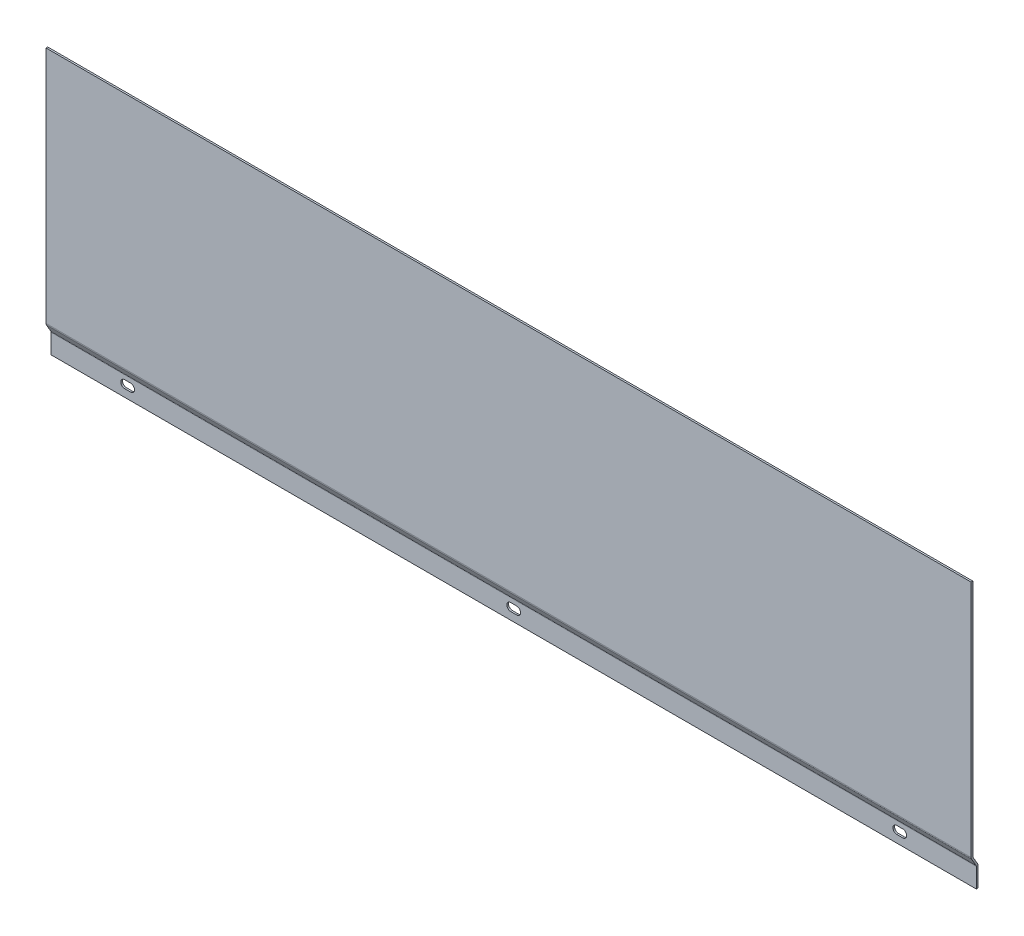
ISO-10303-21;
HEADER;
FILE_DESCRIPTION(('STEP AP214'),'2;1');
FILE_NAME('part.step','',(''),(''),'','','');
FILE_SCHEMA(('AUTOMOTIVE_DESIGN { 1 0 10303 214 1 1 1 1 }'));
ENDSEC;
DATA;
#1=APPLICATION_CONTEXT('core data for automotive mechanical design processes');
#2=APPLICATION_PROTOCOL_DEFINITION('international standard','automotive_design',2000,#1);
#3=PRODUCT_CONTEXT('',#1,'mechanical');
#4=PRODUCT('Part','Part','',(#3));
#5=PRODUCT_RELATED_PRODUCT_CATEGORY('part','',(#4));
#6=PRODUCT_DEFINITION_FORMATION('','',#4);
#7=PRODUCT_DEFINITION_CONTEXT('part definition',#1,'design');
#8=PRODUCT_DEFINITION('design','',#6,#7);
#9=PRODUCT_DEFINITION_SHAPE('','',#8);
#10=(LENGTH_UNIT() NAMED_UNIT(*) SI_UNIT(.MILLI.,.METRE.));
#11=(NAMED_UNIT(*) PLANE_ANGLE_UNIT() SI_UNIT($,.RADIAN.));
#12=(NAMED_UNIT(*) SI_UNIT($,.STERADIAN.) SOLID_ANGLE_UNIT());
#13=UNCERTAINTY_MEASURE_WITH_UNIT(LENGTH_MEASURE(1.E-05),#10,'distance_accuracy_value','');
#14=(GEOMETRIC_REPRESENTATION_CONTEXT(3) GLOBAL_UNCERTAINTY_ASSIGNED_CONTEXT((#13)) GLOBAL_UNIT_ASSIGNED_CONTEXT((#10,
#11,#12)) REPRESENTATION_CONTEXT('',''));
#15=CARTESIAN_POINT('',(0.,0.,0.));
#16=DIRECTION('',(0.,0.,1.));
#17=DIRECTION('',(1.,0.,0.));
#18=AXIS2_PLACEMENT_3D('',#15,#16,#17);
#19=CARTESIAN_POINT('',(810.,25.7942286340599,4.5));
#20=DIRECTION('',(0.,0.,1.));
#21=DIRECTION('',(1.,0.,0.));
#22=AXIS2_PLACEMENT_3D('',#19,#20,#21);
#23=PLANE('',#22);
#24=DIRECTION('',(0.,1.,0.));
#25=VECTOR('',#24,1.);
#26=CARTESIAN_POINT('',(0.,25.7942286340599,4.5));
#27=LINE('',#26,#25);
#28=CARTESIAN_POINT('',(0.,26.1961524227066,4.5));
#29=VERTEX_POINT('',#28);
#30=CARTESIAN_POINT('',(0.,235.,4.5));
#31=VERTEX_POINT('',#30);
#32=EDGE_CURVE('E291',#29,#31,#27,.T.);
#33=ORIENTED_EDGE('',*,*,#32,.T.);
#34=DIRECTION('',(-1.,0.,0.));
#35=VECTOR('',#34,1.);
#36=CARTESIAN_POINT('',(810.,235.,4.5));
#37=LINE('',#36,#35);
#38=CARTESIAN_POINT('',(810.,235.,4.5));
#39=VERTEX_POINT('',#38);
#40=EDGE_CURVE('E423',#39,#31,#37,.T.);
#41=ORIENTED_EDGE('',*,*,#40,.F.);
#42=DIRECTION('',(0.,1.,0.));
#43=VECTOR('',#42,1.);
#44=CARTESIAN_POINT('',(810.,25.7942286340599,4.5));
#45=LINE('',#44,#43);
#46=CARTESIAN_POINT('',(810.,26.1961524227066,4.5));
#47=VERTEX_POINT('',#46);
#48=EDGE_CURVE('E301',#47,#39,#45,.T.);
#49=ORIENTED_EDGE('',*,*,#48,.F.);
#50=DIRECTION('',(-1.,0.,0.));
#51=VECTOR('',#50,1.);
#52=CARTESIAN_POINT('',(810.,26.1961524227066,4.5));
#53=LINE('',#52,#51);
#54=EDGE_CURVE('E345',#47,#29,#53,.T.);
#55=ORIENTED_EDGE('',*,*,#54,.T.);
#56=EDGE_LOOP('',(#33,#41,#49,#55));
#57=FACE_BOUND('',#56,.T.);
#58=ADVANCED_FACE('F38',(#57),#23,.F.);
#59=CARTESIAN_POINT('',(810.,235.,6.));
#60=DIRECTION('',(0.,1.,0.));
#61=DIRECTION('',(0.,0.,1.));
#62=AXIS2_PLACEMENT_3D('',#59,#60,#61);
#63=PLANE('',#62);
#64=DIRECTION('',(0.,0.,-1.));
#65=VECTOR('',#64,1.);
#66=CARTESIAN_POINT('',(0.,235.,6.));
#67=LINE('',#66,#65);
#68=CARTESIAN_POINT('',(0.,235.,6.));
#69=VERTEX_POINT('',#68);
#70=EDGE_CURVE('E348',#69,#31,#67,.T.);
#71=ORIENTED_EDGE('',*,*,#70,.F.);
#72=DIRECTION('',(-1.,0.,0.));
#73=VECTOR('',#72,1.);
#74=CARTESIAN_POINT('',(810.,235.,6.));
#75=LINE('',#74,#73);
#76=CARTESIAN_POINT('',(810.,235.,6.));
#77=VERTEX_POINT('',#76);
#78=EDGE_CURVE('E420',#77,#69,#75,.T.);
#79=ORIENTED_EDGE('',*,*,#78,.F.);
#80=DIRECTION('',(0.,0.,-1.));
#81=VECTOR('',#80,1.);
#82=CARTESIAN_POINT('',(810.,235.,6.));
#83=LINE('',#82,#81);
#84=EDGE_CURVE('E304',#77,#39,#83,.T.);
#85=ORIENTED_EDGE('',*,*,#84,.T.);
#86=ORIENTED_EDGE('',*,*,#40,.T.);
#87=EDGE_LOOP('',(#71,#79,#85,#86));
#88=FACE_BOUND('',#87,.T.);
#89=ADVANCED_FACE('F479',(#88),#63,.T.);
#90=CARTESIAN_POINT('',(810.,25.7942286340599,6.));
#91=DIRECTION('',(0.,0.,1.));
#92=DIRECTION('',(1.,0.,0.));
#93=AXIS2_PLACEMENT_3D('',#90,#91,#92);
#94=PLANE('',#93);
#95=DIRECTION('',(0.,1.,0.));
#96=VECTOR('',#95,1.);
#97=CARTESIAN_POINT('',(0.,25.7942286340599,6.));
#98=LINE('',#97,#96);
#99=CARTESIAN_POINT('',(0.,26.1961524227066,6.));
#100=VERTEX_POINT('',#99);
#101=EDGE_CURVE('E352',#100,#69,#98,.T.);
#102=ORIENTED_EDGE('',*,*,#101,.F.);
#103=DIRECTION('',(-1.,0.,0.));
#104=VECTOR('',#103,1.);
#105=CARTESIAN_POINT('',(810.,26.1961524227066,6.));
#106=LINE('',#105,#104);
#107=CARTESIAN_POINT('',(810.,26.1961524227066,6.));
#108=VERTEX_POINT('',#107);
#109=EDGE_CURVE('E417',#108,#100,#106,.T.);
#110=ORIENTED_EDGE('',*,*,#109,.F.);
#111=DIRECTION('',(0.,1.,0.));
#112=VECTOR('',#111,1.);
#113=CARTESIAN_POINT('',(810.,25.7942286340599,6.));
#114=LINE('',#113,#112);
#115=EDGE_CURVE('E309',#108,#77,#114,.T.);
#116=ORIENTED_EDGE('',*,*,#115,.T.);
#117=ORIENTED_EDGE('',*,*,#78,.T.);
#118=EDGE_LOOP('',(#102,#110,#116,#117));
#119=FACE_BOUND('',#118,.T.);
#120=ADVANCED_FACE('F40',(#119),#94,.T.);
#121=CARTESIAN_POINT('',(810.,26.1961524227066,3.));
#122=DIRECTION('',(-1.,0.,0.));
#123=DIRECTION('',(0.,0.,1.));
#124=AXIS2_PLACEMENT_3D('',#121,#122,#123);
#125=CYLINDRICAL_SURFACE('',#124,3.);
#126=CARTESIAN_POINT('',(0.,26.1961524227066,3.));
#127=DIRECTION('',(1.,0.,0.));
#128=DIRECTION('',(0.,0.,-1.));
#129=AXIS2_PLACEMENT_3D('',#126,#127,#128);
#130=CIRCLE('',#129,3.);
#131=CARTESIAN_POINT('',(0.,24.6961524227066,5.59807621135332));
#132=VERTEX_POINT('',#131);
#133=EDGE_CURVE('E356',#132,#100,#130,.F.);
#134=ORIENTED_EDGE('',*,*,#133,.F.);
#135=DIRECTION('',(-1.,0.,0.));
#136=VECTOR('',#135,1.);
#137=CARTESIAN_POINT('',(810.,24.6961524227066,5.59807621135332));
#138=LINE('',#137,#136);
#139=CARTESIAN_POINT('',(810.,24.6961524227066,5.59807621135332));
#140=VERTEX_POINT('',#139);
#141=EDGE_CURVE('E414',#140,#132,#138,.T.);
#142=ORIENTED_EDGE('',*,*,#141,.F.);
#143=CARTESIAN_POINT('',(810.,26.1961524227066,3.));
#144=DIRECTION('',(1.,0.,0.));
#145=DIRECTION('',(0.,0.,-1.));
#146=AXIS2_PLACEMENT_3D('',#143,#144,#145);
#147=CIRCLE('',#146,3.);
#148=EDGE_CURVE('E313',#140,#108,#147,.F.);
#149=ORIENTED_EDGE('',*,*,#148,.T.);
#150=ORIENTED_EDGE('',*,*,#109,.T.);
#151=EDGE_LOOP('',(#134,#142,#149,#150));
#152=FACE_BOUND('',#151,.T.);
#153=ADVANCED_FACE('F487',(#152),#125,.T.);
#154=CARTESIAN_POINT('',(810.,17.25,1.29903810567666));
#155=DIRECTION('',(0.,-0.5,0.866025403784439));
#156=DIRECTION('',(0.,-0.866025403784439,-0.5));
#157=AXIS2_PLACEMENT_3D('',#154,#155,#156);
#158=PLANE('',#157);
#159=DIRECTION('',(0.,0.866025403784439,0.5));
#160=VECTOR('',#159,1.);
#161=CARTESIAN_POINT('',(0.,17.25,1.29903810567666));
#162=LINE('',#161,#160);
#163=CARTESIAN_POINT('',(0.,17.9461524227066,1.70096189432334));
#164=VERTEX_POINT('',#163);
#165=EDGE_CURVE('E360',#164,#132,#162,.T.);
#166=ORIENTED_EDGE('',*,*,#165,.F.);
#167=DIRECTION('',(-1.,0.,0.));
#168=VECTOR('',#167,1.);
#169=CARTESIAN_POINT('',(810.,17.9461524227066,1.70096189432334));
#170=LINE('',#169,#168);
#171=CARTESIAN_POINT('',(810.,17.9461524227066,1.70096189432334));
#172=VERTEX_POINT('',#171);
#173=EDGE_CURVE('E411',#172,#164,#170,.T.);
#174=ORIENTED_EDGE('',*,*,#173,.F.);
#175=DIRECTION('',(0.,0.866025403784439,0.5));
#176=VECTOR('',#175,1.);
#177=CARTESIAN_POINT('',(810.,17.25,1.29903810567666));
#178=LINE('',#177,#176);
#179=EDGE_CURVE('E317',#172,#140,#178,.T.);
#180=ORIENTED_EDGE('',*,*,#179,.T.);
#181=ORIENTED_EDGE('',*,*,#141,.T.);
#182=EDGE_LOOP('',(#166,#174,#180,#181));
#183=FACE_BOUND('',#182,.T.);
#184=ADVANCED_FACE('F490',(#183),#158,.T.);
#185=CARTESIAN_POINT('',(810.,17.1961524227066,3.));
#186=DIRECTION('',(-1.,0.,0.));
#187=DIRECTION('',(0.,0.,1.));
#188=AXIS2_PLACEMENT_3D('',#185,#186,#187);
#189=CYLINDRICAL_SURFACE('',#188,1.5);
#190=CARTESIAN_POINT('',(0.,17.1961524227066,3.));
#191=DIRECTION('',(1.,0.,0.));
#192=DIRECTION('',(0.,0.,-1.));
#193=AXIS2_PLACEMENT_3D('',#190,#191,#192);
#194=CIRCLE('',#193,1.5);
#195=CARTESIAN_POINT('',(0.,17.1961524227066,1.5));
#196=VERTEX_POINT('',#195);
#197=EDGE_CURVE('E364',#196,#164,#194,.T.);
#198=ORIENTED_EDGE('',*,*,#197,.F.);
#199=DIRECTION('',(-1.,0.,0.));
#200=VECTOR('',#199,1.);
#201=CARTESIAN_POINT('',(810.,17.1961524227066,1.5));
#202=LINE('',#201,#200);
#203=CARTESIAN_POINT('',(810.,17.1961524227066,1.5));
#204=VERTEX_POINT('',#203);
#205=EDGE_CURVE('E408',#204,#196,#202,.T.);
#206=ORIENTED_EDGE('',*,*,#205,.F.);
#207=CARTESIAN_POINT('',(810.,17.1961524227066,3.));
#208=DIRECTION('',(1.,0.,0.));
#209=DIRECTION('',(0.,0.,-1.));
#210=AXIS2_PLACEMENT_3D('',#207,#208,#209);
#211=CIRCLE('',#210,1.5);
#212=EDGE_CURVE('E321',#204,#172,#211,.T.);
#213=ORIENTED_EDGE('',*,*,#212,.T.);
#214=ORIENTED_EDGE('',*,*,#173,.T.);
#215=EDGE_LOOP('',(#198,#206,#213,#214));
#216=FACE_BOUND('',#215,.T.);
#217=ADVANCED_FACE('F494',(#216),#189,.F.);
#218=CARTESIAN_POINT('',(810.,0.,1.5));
#219=DIRECTION('',(0.,0.,1.));
#220=DIRECTION('',(1.,0.,0.));
#221=AXIS2_PLACEMENT_3D('',#218,#219,#220);
#222=PLANE('',#221);
#223=CARTESIAN_POINT('',(402.4,10.,1.5));
#224=DIRECTION('',(0.,0.,1.));
#225=DIRECTION('',(-1.,0.,0.));
#226=AXIS2_PLACEMENT_3D('',#223,#224,#225);
#227=CIRCLE('',#226,3.4);
#228=CARTESIAN_POINT('',(402.4,13.4,1.5));
#229=VERTEX_POINT('',#228);
#230=CARTESIAN_POINT('',(402.4,6.6,1.5));
#231=VERTEX_POINT('',#230);
#232=EDGE_CURVE('E249',#229,#231,#227,.T.);
#233=ORIENTED_EDGE('',*,*,#232,.F.);
#234=DIRECTION('',(-1.,0.,0.));
#235=VECTOR('',#234,1.);
#236=CARTESIAN_POINT('',(402.4,13.4,1.5));
#237=LINE('',#236,#235);
#238=CARTESIAN_POINT('',(407.6,13.4,1.5));
#239=VERTEX_POINT('',#238);
#240=EDGE_CURVE('E226',#239,#229,#237,.T.);
#241=ORIENTED_EDGE('',*,*,#240,.F.);
#242=CARTESIAN_POINT('',(407.6,10.,1.5));
#243=DIRECTION('',(0.,0.,1.));
#244=DIRECTION('',(1.,0.,0.));
#245=AXIS2_PLACEMENT_3D('',#242,#243,#244);
#246=CIRCLE('',#245,3.4);
#247=CARTESIAN_POINT('',(407.6,6.6,1.5));
#248=VERTEX_POINT('',#247);
#249=EDGE_CURVE('E217',#248,#239,#246,.T.);
#250=ORIENTED_EDGE('',*,*,#249,.F.);
#251=DIRECTION('',(1.,0.,0.));
#252=VECTOR('',#251,1.);
#253=CARTESIAN_POINT('',(402.4,6.6,1.5));
#254=LINE('',#253,#252);
#255=EDGE_CURVE('E202',#231,#248,#254,.T.);
#256=ORIENTED_EDGE('',*,*,#255,.F.);
#257=EDGE_LOOP('',(#233,#241,#250,#256));
#258=FACE_BOUND('',#257,.T.);
#259=CARTESIAN_POINT('',(64.4,10.,1.5));
#260=DIRECTION('',(0.,0.,1.));
#261=DIRECTION('',(-1.,0.,0.));
#262=AXIS2_PLACEMENT_3D('',#259,#260,#261);
#263=CIRCLE('',#262,3.4);
#264=CARTESIAN_POINT('',(64.4,13.4,1.5));
#265=VERTEX_POINT('',#264);
#266=CARTESIAN_POINT('',(64.4,6.6,1.5));
#267=VERTEX_POINT('',#266);
#268=EDGE_CURVE('E256',#265,#267,#263,.T.);
#269=ORIENTED_EDGE('',*,*,#268,.F.);
#270=DIRECTION('',(-1.,0.,0.));
#271=VECTOR('',#270,1.);
#272=CARTESIAN_POINT('',(64.4,13.4,1.5));
#273=LINE('',#272,#271);
#274=CARTESIAN_POINT('',(69.6,13.4,1.5));
#275=VERTEX_POINT('',#274);
#276=EDGE_CURVE('E262',#275,#265,#273,.T.);
#277=ORIENTED_EDGE('',*,*,#276,.F.);
#278=CARTESIAN_POINT('',(69.6,10.,1.5));
#279=DIRECTION('',(0.,0.,1.));
#280=DIRECTION('',(1.,0.,0.));
#281=AXIS2_PLACEMENT_3D('',#278,#279,#280);
#282=CIRCLE('',#281,3.4);
#283=CARTESIAN_POINT('',(69.6,6.6,1.5));
#284=VERTEX_POINT('',#283);
#285=EDGE_CURVE('E281',#284,#275,#282,.T.);
#286=ORIENTED_EDGE('',*,*,#285,.F.);
#287=DIRECTION('',(1.,0.,0.));
#288=VECTOR('',#287,1.);
#289=CARTESIAN_POINT('',(64.4,6.6,1.5));
#290=LINE('',#289,#288);
#291=EDGE_CURVE('E277',#267,#284,#290,.T.);
#292=ORIENTED_EDGE('',*,*,#291,.F.);
#293=EDGE_LOOP('',(#269,#277,#286,#292));
#294=FACE_BOUND('',#293,.T.);
#295=DIRECTION('',(0.,1.,0.));
#296=VECTOR('',#295,1.);
#297=CARTESIAN_POINT('',(0.,0.,1.5));
#298=LINE('',#297,#296);
#299=CARTESIAN_POINT('',(0.,0.,1.5));
#300=VERTEX_POINT('',#299);
#301=EDGE_CURVE('E368',#300,#196,#298,.T.);
#302=ORIENTED_EDGE('',*,*,#301,.F.);
#303=DIRECTION('',(-1.,0.,0.));
#304=VECTOR('',#303,1.);
#305=CARTESIAN_POINT('',(810.,0.,1.5));
#306=LINE('',#305,#304);
#307=CARTESIAN_POINT('',(810.,0.,1.5));
#308=VERTEX_POINT('',#307);
#309=EDGE_CURVE('E405',#308,#300,#306,.T.);
#310=ORIENTED_EDGE('',*,*,#309,.F.);
#311=DIRECTION('',(0.,1.,0.));
#312=VECTOR('',#311,1.);
#313=CARTESIAN_POINT('',(810.,0.,1.5));
#314=LINE('',#313,#312);
#315=EDGE_CURVE('E325',#308,#204,#314,.T.);
#316=ORIENTED_EDGE('',*,*,#315,.T.);
#317=ORIENTED_EDGE('',*,*,#205,.T.);
#318=EDGE_LOOP('',(#302,#310,#316,#317));
#319=FACE_BOUND('',#318,.T.);
#320=CARTESIAN_POINT('',(740.4,10.,1.5));
#321=DIRECTION('',(0.,0.,1.));
#322=DIRECTION('',(-1.,0.,0.));
#323=AXIS2_PLACEMENT_3D('',#320,#321,#322);
#324=CIRCLE('',#323,3.4);
#325=CARTESIAN_POINT('',(740.4,13.4,1.5));
#326=VERTEX_POINT('',#325);
#327=CARTESIAN_POINT('',(740.4,6.6,1.5));
#328=VERTEX_POINT('',#327);
#329=EDGE_CURVE('E426',#326,#328,#324,.T.);
#330=ORIENTED_EDGE('',*,*,#329,.F.);
#331=DIRECTION('',(-1.,0.,0.));
#332=VECTOR('',#331,1.);
#333=CARTESIAN_POINT('',(740.4,13.4,1.5));
#334=LINE('',#333,#332);
#335=CARTESIAN_POINT('',(745.6,13.4,1.5));
#336=VERTEX_POINT('',#335);
#337=EDGE_CURVE('E429',#336,#326,#334,.T.);
#338=ORIENTED_EDGE('',*,*,#337,.F.);
#339=CARTESIAN_POINT('',(745.6,10.,1.5));
#340=DIRECTION('',(0.,0.,1.));
#341=DIRECTION('',(1.,0.,0.));
#342=AXIS2_PLACEMENT_3D('',#339,#340,#341);
#343=CIRCLE('',#342,3.4);
#344=CARTESIAN_POINT('',(745.6,6.6,1.5));
#345=VERTEX_POINT('',#344);
#346=EDGE_CURVE('E432',#345,#336,#343,.T.);
#347=ORIENTED_EDGE('',*,*,#346,.F.);
#348=DIRECTION('',(1.,0.,0.));
#349=VECTOR('',#348,1.);
#350=CARTESIAN_POINT('',(740.4,6.6,1.5));
#351=LINE('',#350,#349);
#352=EDGE_CURVE('E436',#328,#345,#351,.T.);
#353=ORIENTED_EDGE('',*,*,#352,.F.);
#354=EDGE_LOOP('',(#330,#338,#347,#353));
#355=FACE_BOUND('',#354,.T.);
#356=ADVANCED_FACE('F224',(#258,#294,#319,#355),#222,.T.);
#357=CARTESIAN_POINT('',(810.,0.,0.));
#358=DIRECTION('',(0.,-1.,0.));
#359=DIRECTION('',(0.,0.,-1.));
#360=AXIS2_PLACEMENT_3D('',#357,#358,#359);
#361=PLANE('',#360);
#362=DIRECTION('',(0.,0.,1.));
#363=VECTOR('',#362,1.);
#364=CARTESIAN_POINT('',(0.,0.,0.));
#365=LINE('',#364,#363);
#366=CARTESIAN_POINT('',(0.,0.,0.));
#367=VERTEX_POINT('',#366);
#368=EDGE_CURVE('E372',#367,#300,#365,.T.);
#369=ORIENTED_EDGE('',*,*,#368,.F.);
#370=DIRECTION('',(-1.,0.,0.));
#371=VECTOR('',#370,1.);
#372=CARTESIAN_POINT('',(810.,0.,0.));
#373=LINE('',#372,#371);
#374=CARTESIAN_POINT('',(810.,0.,0.));
#375=VERTEX_POINT('',#374);
#376=EDGE_CURVE('E402',#375,#367,#373,.T.);
#377=ORIENTED_EDGE('',*,*,#376,.F.);
#378=DIRECTION('',(0.,0.,1.));
#379=VECTOR('',#378,1.);
#380=CARTESIAN_POINT('',(810.,0.,0.));
#381=LINE('',#380,#379);
#382=EDGE_CURVE('E329',#375,#308,#381,.T.);
#383=ORIENTED_EDGE('',*,*,#382,.T.);
#384=ORIENTED_EDGE('',*,*,#309,.T.);
#385=EDGE_LOOP('',(#369,#377,#383,#384));
#386=FACE_BOUND('',#385,.T.);
#387=ADVANCED_FACE('F501',(#386),#361,.T.);
#388=CARTESIAN_POINT('',(810.,0.,0.));
#389=DIRECTION('',(0.,0.,1.));
#390=DIRECTION('',(1.,0.,0.));
#391=AXIS2_PLACEMENT_3D('',#388,#389,#390);
#392=PLANE('',#391);
#393=DIRECTION('',(-1.,0.,0.));
#394=VECTOR('',#393,1.);
#395=CARTESIAN_POINT('',(402.4,13.4,0.));
#396=LINE('',#395,#394);
#397=CARTESIAN_POINT('',(407.6,13.4,0.));
#398=VERTEX_POINT('',#397);
#399=CARTESIAN_POINT('',(402.4,13.4,0.));
#400=VERTEX_POINT('',#399);
#401=EDGE_CURVE('E245',#398,#400,#396,.T.);
#402=ORIENTED_EDGE('',*,*,#401,.T.);
#403=CARTESIAN_POINT('',(402.4,10.,0.));
#404=DIRECTION('',(0.,0.,1.));
#405=DIRECTION('',(-1.,0.,0.));
#406=AXIS2_PLACEMENT_3D('',#403,#404,#405);
#407=CIRCLE('',#406,3.4);
#408=CARTESIAN_POINT('',(402.4,6.6,0.));
#409=VERTEX_POINT('',#408);
#410=EDGE_CURVE('E252',#400,#409,#407,.T.);
#411=ORIENTED_EDGE('',*,*,#410,.T.);
#412=DIRECTION('',(1.,0.,0.));
#413=VECTOR('',#412,1.);
#414=CARTESIAN_POINT('',(402.4,6.6,0.));
#415=LINE('',#414,#413);
#416=CARTESIAN_POINT('',(407.6,6.6,0.));
#417=VERTEX_POINT('',#416);
#418=EDGE_CURVE('E213',#409,#417,#415,.T.);
#419=ORIENTED_EDGE('',*,*,#418,.T.);
#420=CARTESIAN_POINT('',(407.6,10.,0.));
#421=DIRECTION('',(0.,0.,1.));
#422=DIRECTION('',(1.,0.,0.));
#423=AXIS2_PLACEMENT_3D('',#420,#421,#422);
#424=CIRCLE('',#423,3.4);
#425=EDGE_CURVE('E220',#417,#398,#424,.T.);
#426=ORIENTED_EDGE('',*,*,#425,.T.);
#427=EDGE_LOOP('',(#402,#411,#419,#426));
#428=FACE_BOUND('',#427,.T.);
#429=DIRECTION('',(-1.,0.,0.));
#430=VECTOR('',#429,1.);
#431=CARTESIAN_POINT('',(64.4,13.4,0.));
#432=LINE('',#431,#430);
#433=CARTESIAN_POINT('',(69.6,13.4,0.));
#434=VERTEX_POINT('',#433);
#435=CARTESIAN_POINT('',(64.4,13.4,0.));
#436=VERTEX_POINT('',#435);
#437=EDGE_CURVE('E270',#434,#436,#432,.T.);
#438=ORIENTED_EDGE('',*,*,#437,.T.);
#439=CARTESIAN_POINT('',(64.4,10.,0.));
#440=DIRECTION('',(0.,0.,1.));
#441=DIRECTION('',(-1.,0.,0.));
#442=AXIS2_PLACEMENT_3D('',#439,#440,#441);
#443=CIRCLE('',#442,3.4);
#444=CARTESIAN_POINT('',(64.4,6.6,0.));
#445=VERTEX_POINT('',#444);
#446=EDGE_CURVE('E257',#436,#445,#443,.T.);
#447=ORIENTED_EDGE('',*,*,#446,.T.);
#448=DIRECTION('',(1.,0.,0.));
#449=VECTOR('',#448,1.);
#450=CARTESIAN_POINT('',(64.4,6.6,0.));
#451=LINE('',#450,#449);
#452=CARTESIAN_POINT('',(69.6,6.6,0.));
#453=VERTEX_POINT('',#452);
#454=EDGE_CURVE('E261',#445,#453,#451,.T.);
#455=ORIENTED_EDGE('',*,*,#454,.T.);
#456=CARTESIAN_POINT('',(69.6,10.,0.));
#457=DIRECTION('',(0.,0.,1.));
#458=DIRECTION('',(1.,0.,0.));
#459=AXIS2_PLACEMENT_3D('',#456,#457,#458);
#460=CIRCLE('',#459,3.4);
#461=EDGE_CURVE('E266',#453,#434,#460,.T.);
#462=ORIENTED_EDGE('',*,*,#461,.T.);
#463=EDGE_LOOP('',(#438,#447,#455,#462));
#464=FACE_BOUND('',#463,.T.);
#465=DIRECTION('',(0.,1.,0.));
#466=VECTOR('',#465,1.);
#467=CARTESIAN_POINT('',(0.,0.,0.));
#468=LINE('',#467,#466);
#469=CARTESIAN_POINT('',(0.,17.1961524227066,0.));
#470=VERTEX_POINT('',#469);
#471=EDGE_CURVE('E376',#367,#470,#468,.T.);
#472=ORIENTED_EDGE('',*,*,#471,.T.);
#473=DIRECTION('',(-1.,0.,0.));
#474=VECTOR('',#473,1.);
#475=CARTESIAN_POINT('',(810.,17.1961524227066,0.));
#476=LINE('',#475,#474);
#477=CARTESIAN_POINT('',(810.,17.1961524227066,0.));
#478=VERTEX_POINT('',#477);
#479=EDGE_CURVE('E398',#478,#470,#476,.T.);
#480=ORIENTED_EDGE('',*,*,#479,.F.);
#481=DIRECTION('',(0.,1.,0.));
#482=VECTOR('',#481,1.);
#483=CARTESIAN_POINT('',(810.,0.,0.));
#484=LINE('',#483,#482);
#485=EDGE_CURVE('E333',#375,#478,#484,.T.);
#486=ORIENTED_EDGE('',*,*,#485,.F.);
#487=ORIENTED_EDGE('',*,*,#376,.T.);
#488=EDGE_LOOP('',(#472,#480,#486,#487));
#489=FACE_BOUND('',#488,.T.);
#490=CARTESIAN_POINT('',(740.4,10.,0.));
#491=DIRECTION('',(0.,0.,1.));
#492=DIRECTION('',(-1.,0.,0.));
#493=AXIS2_PLACEMENT_3D('',#490,#491,#492);
#494=CIRCLE('',#493,3.4);
#495=CARTESIAN_POINT('',(740.4,13.4,0.));
#496=VERTEX_POINT('',#495);
#497=CARTESIAN_POINT('',(740.4,6.6,0.));
#498=VERTEX_POINT('',#497);
#499=EDGE_CURVE('E54',#496,#498,#494,.T.);
#500=ORIENTED_EDGE('',*,*,#499,.T.);
#501=DIRECTION('',(1.,0.,0.));
#502=VECTOR('',#501,1.);
#503=CARTESIAN_POINT('',(740.4,6.6,0.));
#504=LINE('',#503,#502);
#505=CARTESIAN_POINT('',(745.6,6.6,0.));
#506=VERTEX_POINT('',#505);
#507=EDGE_CURVE('E442',#498,#506,#504,.T.);
#508=ORIENTED_EDGE('',*,*,#507,.T.);
#509=CARTESIAN_POINT('',(745.6,10.,0.));
#510=DIRECTION('',(0.,0.,1.));
#511=DIRECTION('',(1.,0.,0.));
#512=AXIS2_PLACEMENT_3D('',#509,#510,#511);
#513=CIRCLE('',#512,3.4);
#514=CARTESIAN_POINT('',(745.6,13.4,0.));
#515=VERTEX_POINT('',#514);
#516=EDGE_CURVE('E61',#506,#515,#513,.T.);
#517=ORIENTED_EDGE('',*,*,#516,.T.);
#518=DIRECTION('',(-1.,0.,0.));
#519=VECTOR('',#518,1.);
#520=CARTESIAN_POINT('',(740.4,13.4,0.));
#521=LINE('',#520,#519);
#522=EDGE_CURVE('E447',#515,#496,#521,.T.);
#523=ORIENTED_EDGE('',*,*,#522,.T.);
#524=EDGE_LOOP('',(#500,#508,#517,#523));
#525=FACE_BOUND('',#524,.T.);
#526=ADVANCED_FACE('F504',(#428,#464,#489,#525),#392,.F.);
#527=CARTESIAN_POINT('',(810.,17.1961524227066,3.));
#528=DIRECTION('',(-1.,0.,0.));
#529=DIRECTION('',(0.,0.,1.));
#530=AXIS2_PLACEMENT_3D('',#527,#528,#529);
#531=CYLINDRICAL_SURFACE('',#530,3.);
#532=CARTESIAN_POINT('',(0.,17.1961524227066,3.));
#533=DIRECTION('',(-1.,0.,0.));
#534=DIRECTION('',(0.,0.,1.));
#535=AXIS2_PLACEMENT_3D('',#532,#533,#534);
#536=CIRCLE('',#535,3.);
#537=CARTESIAN_POINT('',(0.,18.6961524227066,0.401923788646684));
#538=VERTEX_POINT('',#537);
#539=EDGE_CURVE('E379',#470,#538,#536,.F.);
#540=ORIENTED_EDGE('',*,*,#539,.T.);
#541=DIRECTION('',(-1.,0.,0.));
#542=VECTOR('',#541,1.);
#543=CARTESIAN_POINT('',(810.,18.6961524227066,0.401923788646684));
#544=LINE('',#543,#542);
#545=CARTESIAN_POINT('',(810.,18.6961524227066,0.401923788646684));
#546=VERTEX_POINT('',#545);
#547=EDGE_CURVE('E394',#546,#538,#544,.T.);
#548=ORIENTED_EDGE('',*,*,#547,.F.);
#549=CARTESIAN_POINT('',(810.,17.1961524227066,3.));
#550=DIRECTION('',(-1.,0.,0.));
#551=DIRECTION('',(0.,0.,1.));
#552=AXIS2_PLACEMENT_3D('',#549,#550,#551);
#553=CIRCLE('',#552,3.);
#554=EDGE_CURVE('E336',#478,#546,#553,.F.);
#555=ORIENTED_EDGE('',*,*,#554,.F.);
#556=ORIENTED_EDGE('',*,*,#479,.T.);
#557=EDGE_LOOP('',(#540,#548,#555,#556));
#558=FACE_BOUND('',#557,.T.);
#559=ADVANCED_FACE('F508',(#558),#531,.T.);
#560=CARTESIAN_POINT('',(810.,18.,0.));
#561=DIRECTION('',(0.,-0.5,0.866025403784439));
#562=DIRECTION('',(0.,-0.866025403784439,-0.5));
#563=AXIS2_PLACEMENT_3D('',#560,#561,#562);
#564=PLANE('',#563);
#565=DIRECTION('',(0.,0.866025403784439,0.5));
#566=VECTOR('',#565,1.);
#567=CARTESIAN_POINT('',(0.,18.,0.));
#568=LINE('',#567,#566);
#569=CARTESIAN_POINT('',(0.,25.4461524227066,4.29903810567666));
#570=VERTEX_POINT('',#569);
#571=EDGE_CURVE('E382',#538,#570,#568,.T.);
#572=ORIENTED_EDGE('',*,*,#571,.T.);
#573=DIRECTION('',(-1.,0.,0.));
#574=VECTOR('',#573,1.);
#575=CARTESIAN_POINT('',(810.,25.4461524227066,4.29903810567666));
#576=LINE('',#575,#574);
#577=CARTESIAN_POINT('',(810.,25.4461524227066,4.29903810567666));
#578=VERTEX_POINT('',#577);
#579=EDGE_CURVE('E390',#578,#570,#576,.T.);
#580=ORIENTED_EDGE('',*,*,#579,.F.);
#581=DIRECTION('',(0.,0.866025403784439,0.5));
#582=VECTOR('',#581,1.);
#583=CARTESIAN_POINT('',(810.,18.,0.));
#584=LINE('',#583,#582);
#585=EDGE_CURVE('E339',#546,#578,#584,.T.);
#586=ORIENTED_EDGE('',*,*,#585,.F.);
#587=ORIENTED_EDGE('',*,*,#547,.T.);
#588=EDGE_LOOP('',(#572,#580,#586,#587));
#589=FACE_BOUND('',#588,.T.);
#590=ADVANCED_FACE('F512',(#589),#564,.F.);
#591=CARTESIAN_POINT('',(810.,26.1961524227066,3.));
#592=DIRECTION('',(-1.,0.,0.));
#593=DIRECTION('',(0.,0.,1.));
#594=AXIS2_PLACEMENT_3D('',#591,#592,#593);
#595=CYLINDRICAL_SURFACE('',#594,1.5);
#596=CARTESIAN_POINT('',(0.,26.1961524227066,3.));
#597=DIRECTION('',(1.,0.,0.));
#598=DIRECTION('',(0.,0.,-1.));
#599=AXIS2_PLACEMENT_3D('',#596,#597,#598);
#600=CIRCLE('',#599,1.5);
#601=EDGE_CURVE('E305',#570,#29,#600,.F.);
#602=ORIENTED_EDGE('',*,*,#601,.T.);
#603=ORIENTED_EDGE('',*,*,#54,.F.);
#604=CARTESIAN_POINT('',(810.,26.1961524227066,3.));
#605=DIRECTION('',(1.,0.,0.));
#606=DIRECTION('',(0.,0.,-1.));
#607=AXIS2_PLACEMENT_3D('',#604,#605,#606);
#608=CIRCLE('',#607,1.5);
#609=EDGE_CURVE('E342',#578,#47,#608,.F.);
#610=ORIENTED_EDGE('',*,*,#609,.F.);
#611=ORIENTED_EDGE('',*,*,#579,.T.);
#612=EDGE_LOOP('',(#602,#603,#610,#611));
#613=FACE_BOUND('',#612,.T.);
#614=ADVANCED_FACE('F516',(#613),#595,.F.);
#615=CARTESIAN_POINT('',(810.,26.1961524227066,3.));
#616=DIRECTION('',(1.,0.,0.));
#617=DIRECTION('',(0.,0.,-1.));
#618=AXIS2_PLACEMENT_3D('',#615,#616,#617);
#619=PLANE('',#618);
#620=ORIENTED_EDGE('',*,*,#48,.T.);
#621=ORIENTED_EDGE('',*,*,#84,.F.);
#622=ORIENTED_EDGE('',*,*,#115,.F.);
#623=ORIENTED_EDGE('',*,*,#148,.F.);
#624=ORIENTED_EDGE('',*,*,#179,.F.);
#625=ORIENTED_EDGE('',*,*,#212,.F.);
#626=ORIENTED_EDGE('',*,*,#315,.F.);
#627=ORIENTED_EDGE('',*,*,#382,.F.);
#628=ORIENTED_EDGE('',*,*,#485,.T.);
#629=ORIENTED_EDGE('',*,*,#554,.T.);
#630=ORIENTED_EDGE('',*,*,#585,.T.);
#631=ORIENTED_EDGE('',*,*,#609,.T.);
#632=EDGE_LOOP('',(#620,#621,#622,#623,#624,#625,#626,#627,#628,#629,#630,#631));
#633=FACE_BOUND('',#632,.T.);
#634=ADVANCED_FACE('F520',(#633),#619,.T.);
#635=CARTESIAN_POINT('',(0.,26.1961524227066,3.));
#636=DIRECTION('',(1.,0.,0.));
#637=DIRECTION('',(0.,0.,-1.));
#638=AXIS2_PLACEMENT_3D('',#635,#636,#637);
#639=PLANE('',#638);
#640=ORIENTED_EDGE('',*,*,#301,.T.);
#641=ORIENTED_EDGE('',*,*,#197,.T.);
#642=ORIENTED_EDGE('',*,*,#165,.T.);
#643=ORIENTED_EDGE('',*,*,#133,.T.);
#644=ORIENTED_EDGE('',*,*,#101,.T.);
#645=ORIENTED_EDGE('',*,*,#70,.T.);
#646=ORIENTED_EDGE('',*,*,#32,.F.);
#647=ORIENTED_EDGE('',*,*,#601,.F.);
#648=ORIENTED_EDGE('',*,*,#571,.F.);
#649=ORIENTED_EDGE('',*,*,#539,.F.);
#650=ORIENTED_EDGE('',*,*,#471,.F.);
#651=ORIENTED_EDGE('',*,*,#368,.T.);
#652=EDGE_LOOP('',(#640,#641,#642,#643,#644,#645,#646,#647,#648,#649,#650,#651));
#653=FACE_BOUND('',#652,.T.);
#654=ADVANCED_FACE('F522',(#653),#639,.F.);
#655=CARTESIAN_POINT('',(64.4,10.,0.));
#656=DIRECTION('',(0.,0.,1.));
#657=DIRECTION('',(1.,0.,0.));
#658=AXIS2_PLACEMENT_3D('',#655,#656,#657);
#659=CYLINDRICAL_SURFACE('',#658,3.4);
#660=ORIENTED_EDGE('',*,*,#268,.T.);
#661=DIRECTION('',(0.,0.,1.));
#662=VECTOR('',#661,1.);
#663=CARTESIAN_POINT('',(64.4,6.6,0.));
#664=LINE('',#663,#662);
#665=EDGE_CURVE('E274',#445,#267,#664,.T.);
#666=ORIENTED_EDGE('',*,*,#665,.F.);
#667=ORIENTED_EDGE('',*,*,#446,.F.);
#668=DIRECTION('',(0.,0.,1.));
#669=VECTOR('',#668,1.);
#670=CARTESIAN_POINT('',(64.4,13.4,0.));
#671=LINE('',#670,#669);
#672=EDGE_CURVE('E288',#436,#265,#671,.T.);
#673=ORIENTED_EDGE('',*,*,#672,.T.);
#674=EDGE_LOOP('',(#660,#666,#667,#673));
#675=FACE_BOUND('',#674,.T.);
#676=ADVANCED_FACE('F525',(#675),#659,.F.);
#677=CARTESIAN_POINT('',(64.4,13.4,0.));
#678=DIRECTION('',(0.,1.,0.));
#679=DIRECTION('',(0.,0.,1.));
#680=AXIS2_PLACEMENT_3D('',#677,#678,#679);
#681=PLANE('',#680);
#682=ORIENTED_EDGE('',*,*,#276,.T.);
#683=ORIENTED_EDGE('',*,*,#672,.F.);
#684=ORIENTED_EDGE('',*,*,#437,.F.);
#685=DIRECTION('',(0.,0.,1.));
#686=VECTOR('',#685,1.);
#687=CARTESIAN_POINT('',(69.6,13.4,0.));
#688=LINE('',#687,#686);
#689=EDGE_CURVE('E292',#434,#275,#688,.T.);
#690=ORIENTED_EDGE('',*,*,#689,.T.);
#691=EDGE_LOOP('',(#682,#683,#684,#690));
#692=FACE_BOUND('',#691,.T.);
#693=ADVANCED_FACE('F532',(#692),#681,.F.);
#694=CARTESIAN_POINT('',(69.6,10.,0.));
#695=DIRECTION('',(0.,0.,1.));
#696=DIRECTION('',(1.,0.,0.));
#697=AXIS2_PLACEMENT_3D('',#694,#695,#696);
#698=CYLINDRICAL_SURFACE('',#697,3.4);
#699=ORIENTED_EDGE('',*,*,#285,.T.);
#700=ORIENTED_EDGE('',*,*,#689,.F.);
#701=ORIENTED_EDGE('',*,*,#461,.F.);
#702=DIRECTION('',(0.,0.,1.));
#703=VECTOR('',#702,1.);
#704=CARTESIAN_POINT('',(69.6,6.6,0.));
#705=LINE('',#704,#703);
#706=EDGE_CURVE('E295',#453,#284,#705,.T.);
#707=ORIENTED_EDGE('',*,*,#706,.T.);
#708=EDGE_LOOP('',(#699,#700,#701,#707));
#709=FACE_BOUND('',#708,.T.);
#710=ADVANCED_FACE('F538',(#709),#698,.F.);
#711=CARTESIAN_POINT('',(64.4,6.6,0.));
#712=DIRECTION('',(0.,-1.,0.));
#713=DIRECTION('',(0.,0.,-1.));
#714=AXIS2_PLACEMENT_3D('',#711,#712,#713);
#715=PLANE('',#714);
#716=ORIENTED_EDGE('',*,*,#291,.T.);
#717=ORIENTED_EDGE('',*,*,#706,.F.);
#718=ORIENTED_EDGE('',*,*,#454,.F.);
#719=ORIENTED_EDGE('',*,*,#665,.T.);
#720=EDGE_LOOP('',(#716,#717,#718,#719));
#721=FACE_BOUND('',#720,.T.);
#722=ADVANCED_FACE('F534',(#721),#715,.F.);
#723=CARTESIAN_POINT('',(402.4,10.,0.));
#724=DIRECTION('',(0.,0.,1.));
#725=DIRECTION('',(1.,0.,0.));
#726=AXIS2_PLACEMENT_3D('',#723,#724,#725);
#727=CYLINDRICAL_SURFACE('',#726,3.4);
#728=ORIENTED_EDGE('',*,*,#232,.T.);
#729=DIRECTION('',(0.,0.,1.));
#730=VECTOR('',#729,1.);
#731=CARTESIAN_POINT('',(402.4,6.6,0.));
#732=LINE('',#731,#730);
#733=EDGE_CURVE('E208',#409,#231,#732,.T.);
#734=ORIENTED_EDGE('',*,*,#733,.F.);
#735=ORIENTED_EDGE('',*,*,#410,.F.);
#736=DIRECTION('',(0.,0.,1.));
#737=VECTOR('',#736,1.);
#738=CARTESIAN_POINT('',(402.4,13.4,0.));
#739=LINE('',#738,#737);
#740=EDGE_CURVE('E241',#400,#229,#739,.T.);
#741=ORIENTED_EDGE('',*,*,#740,.T.);
#742=EDGE_LOOP('',(#728,#734,#735,#741));
#743=FACE_BOUND('',#742,.T.);
#744=ADVANCED_FACE('F537',(#743),#727,.F.);
#745=CARTESIAN_POINT('',(402.4,13.4,0.));
#746=DIRECTION('',(0.,1.,0.));
#747=DIRECTION('',(0.,0.,1.));
#748=AXIS2_PLACEMENT_3D('',#745,#746,#747);
#749=PLANE('',#748);
#750=ORIENTED_EDGE('',*,*,#240,.T.);
#751=ORIENTED_EDGE('',*,*,#740,.F.);
#752=ORIENTED_EDGE('',*,*,#401,.F.);
#753=DIRECTION('',(0.,0.,1.));
#754=VECTOR('',#753,1.);
#755=CARTESIAN_POINT('',(407.6,13.4,0.));
#756=LINE('',#755,#754);
#757=EDGE_CURVE('E228',#398,#239,#756,.T.);
#758=ORIENTED_EDGE('',*,*,#757,.T.);
#759=EDGE_LOOP('',(#750,#751,#752,#758));
#760=FACE_BOUND('',#759,.T.);
#761=ADVANCED_FACE('F548',(#760),#749,.F.);
#762=CARTESIAN_POINT('',(407.6,10.,0.));
#763=DIRECTION('',(0.,0.,1.));
#764=DIRECTION('',(1.,0.,0.));
#765=AXIS2_PLACEMENT_3D('',#762,#763,#764);
#766=CYLINDRICAL_SURFACE('',#765,3.4);
#767=ORIENTED_EDGE('',*,*,#249,.T.);
#768=ORIENTED_EDGE('',*,*,#757,.F.);
#769=ORIENTED_EDGE('',*,*,#425,.F.);
#770=DIRECTION('',(0.,0.,1.));
#771=VECTOR('',#770,1.);
#772=CARTESIAN_POINT('',(407.6,6.6,0.));
#773=LINE('',#772,#771);
#774=EDGE_CURVE('E205',#417,#248,#773,.T.);
#775=ORIENTED_EDGE('',*,*,#774,.T.);
#776=EDGE_LOOP('',(#767,#768,#769,#775));
#777=FACE_BOUND('',#776,.T.);
#778=ADVANCED_FACE('F216',(#777),#766,.F.);
#779=CARTESIAN_POINT('',(402.4,6.6,0.));
#780=DIRECTION('',(0.,-1.,0.));
#781=DIRECTION('',(0.,0.,-1.));
#782=AXIS2_PLACEMENT_3D('',#779,#780,#781);
#783=PLANE('',#782);
#784=ORIENTED_EDGE('',*,*,#255,.T.);
#785=ORIENTED_EDGE('',*,*,#774,.F.);
#786=ORIENTED_EDGE('',*,*,#418,.F.);
#787=ORIENTED_EDGE('',*,*,#733,.T.);
#788=EDGE_LOOP('',(#784,#785,#786,#787));
#789=FACE_BOUND('',#788,.T.);
#790=ADVANCED_FACE('F204',(#789),#783,.F.);
#791=CARTESIAN_POINT('',(740.4,6.6,0.));
#792=DIRECTION('',(0.,-1.,0.));
#793=DIRECTION('',(0.,0.,-1.));
#794=AXIS2_PLACEMENT_3D('',#791,#792,#793);
#795=PLANE('',#794);
#796=ORIENTED_EDGE('',*,*,#352,.T.);
#797=DIRECTION('',(0.,0.,1.));
#798=VECTOR('',#797,1.);
#799=CARTESIAN_POINT('',(745.6,6.6,0.));
#800=LINE('',#799,#798);
#801=EDGE_CURVE('E11',#506,#345,#800,.T.);
#802=ORIENTED_EDGE('',*,*,#801,.F.);
#803=ORIENTED_EDGE('',*,*,#507,.F.);
#804=DIRECTION('',(0.,0.,1.));
#805=VECTOR('',#804,1.);
#806=CARTESIAN_POINT('',(740.4,6.6,0.));
#807=LINE('',#806,#805);
#808=EDGE_CURVE('E450',#498,#328,#807,.T.);
#809=ORIENTED_EDGE('',*,*,#808,.T.);
#810=EDGE_LOOP('',(#796,#802,#803,#809));
#811=FACE_BOUND('',#810,.T.);
#812=ADVANCED_FACE('F468',(#811),#795,.F.);
#813=CARTESIAN_POINT('',(745.6,10.,0.));
#814=DIRECTION('',(0.,0.,1.));
#815=DIRECTION('',(1.,0.,0.));
#816=AXIS2_PLACEMENT_3D('',#813,#814,#815);
#817=CYLINDRICAL_SURFACE('',#816,3.4);
#818=ORIENTED_EDGE('',*,*,#346,.T.);
#819=DIRECTION('',(0.,0.,1.));
#820=VECTOR('',#819,1.);
#821=CARTESIAN_POINT('',(745.6,13.4,0.));
#822=LINE('',#821,#820);
#823=EDGE_CURVE('E47',#515,#336,#822,.T.);
#824=ORIENTED_EDGE('',*,*,#823,.F.);
#825=ORIENTED_EDGE('',*,*,#516,.F.);
#826=ORIENTED_EDGE('',*,*,#801,.T.);
#827=EDGE_LOOP('',(#818,#824,#825,#826));
#828=FACE_BOUND('',#827,.T.);
#829=ADVANCED_FACE('F463',(#828),#817,.F.);
#830=CARTESIAN_POINT('',(740.4,13.4,0.));
#831=DIRECTION('',(0.,1.,0.));
#832=DIRECTION('',(0.,0.,1.));
#833=AXIS2_PLACEMENT_3D('',#830,#831,#832);
#834=PLANE('',#833);
#835=ORIENTED_EDGE('',*,*,#337,.T.);
#836=DIRECTION('',(0.,0.,1.));
#837=VECTOR('',#836,1.);
#838=CARTESIAN_POINT('',(740.4,13.4,0.));
#839=LINE('',#838,#837);
#840=EDGE_CURVE('E454',#496,#326,#839,.T.);
#841=ORIENTED_EDGE('',*,*,#840,.F.);
#842=ORIENTED_EDGE('',*,*,#522,.F.);
#843=ORIENTED_EDGE('',*,*,#823,.T.);
#844=EDGE_LOOP('',(#835,#841,#842,#843));
#845=FACE_BOUND('',#844,.T.);
#846=ADVANCED_FACE('F460',(#845),#834,.F.);
#847=CARTESIAN_POINT('',(740.4,10.,0.));
#848=DIRECTION('',(0.,0.,1.));
#849=DIRECTION('',(1.,0.,0.));
#850=AXIS2_PLACEMENT_3D('',#847,#848,#849);
#851=CYLINDRICAL_SURFACE('',#850,3.4);
#852=ORIENTED_EDGE('',*,*,#329,.T.);
#853=ORIENTED_EDGE('',*,*,#808,.F.);
#854=ORIENTED_EDGE('',*,*,#499,.F.);
#855=ORIENTED_EDGE('',*,*,#840,.T.);
#856=EDGE_LOOP('',(#852,#853,#854,#855));
#857=FACE_BOUND('',#856,.T.);
#858=ADVANCED_FACE('F470',(#857),#851,.F.);
#859=CLOSED_SHELL('',(#58,#89,#120,#153,#184,#217,#356,#387,#526,#559,#590,#614,#634,#654,#676,
#693,#710,#722,#744,#761,#778,#790,#812,#829,#846,#858));
#860=MANIFOLD_SOLID_BREP('B2',#859);
#861=ADVANCED_BREP_SHAPE_REPRESENTATION('',(#18,#860),#14);
#862=SHAPE_DEFINITION_REPRESENTATION(#9,#861);
ENDSEC;
END-ISO-10303-21;
